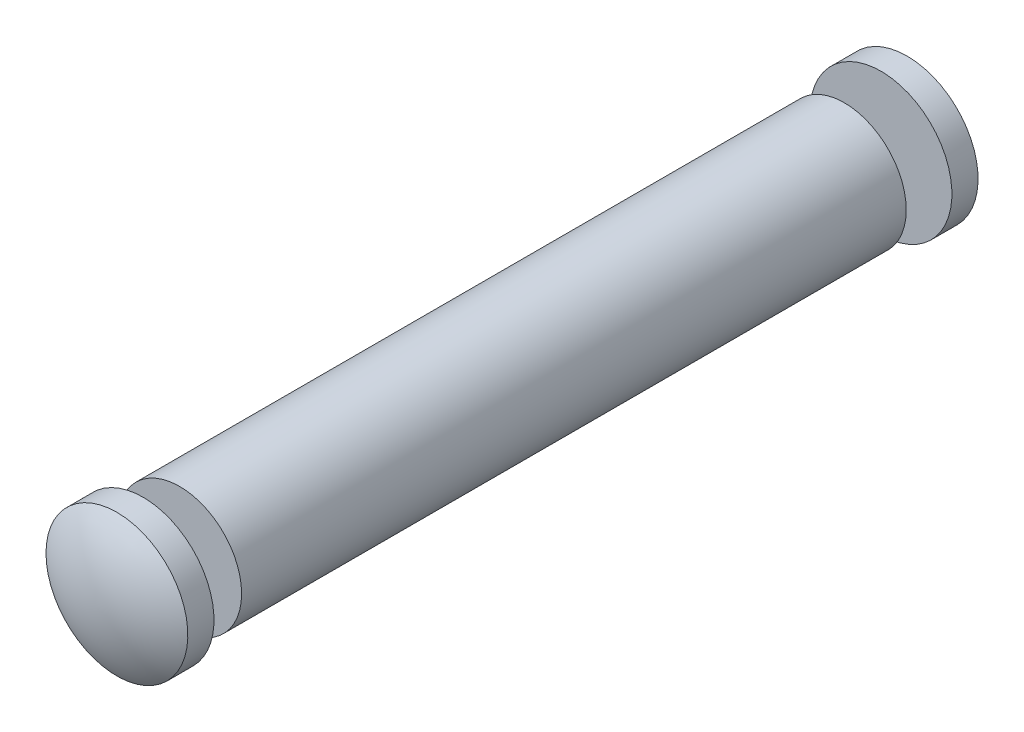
from build123d import *

# Parameters (mm, degrees)
ESQUISSE1_R        = 2.365
BOSS_EXTRU_1_DEPTH = 25.4


with BuildPart() as part:
    # Esquisse1 → Boss.-Extru.1 (new body)
    with BuildSketch(Plane.XY):
        Circle(ESQUISSE1_R)
    extrude(amount=BOSS_EXTRU_1_DEPTH)


with BuildPart() as body_2:
    # Esquisse2 → R_volution1 (revolve)
    with BuildSketch(Plane(origin=(0, 0, 0), x_dir=(0, 0, -1), z_dir=(1, 0, 0))):
        with BuildLine():
            Line((-26.8, 0), (-26.8, 2.71))
            Line((-26.8, 2.71), (-27.8, 2.71))
            ThreePointArc((-27.8, 2.71), (-28.417849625, 1.417127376), (-28.63, 0))
            Line((-28.63, 0), (-26.8, 0))
        make_face()
        with BuildLine():
            Line((3.23, 0), (1.4, 0))
            Line((1.4, 0), (1.4, 2.71))
            Line((1.4, 2.71), (2.4, 2.71))
            ThreePointArc((2.4, 2.71), (3.017849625, 1.417127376), (3.23, 0))
        make_face()
    revolve(axis=Axis((0, 0, 0), (0, 0, 1)))


solid = Compound([part.part, body_2.part])
